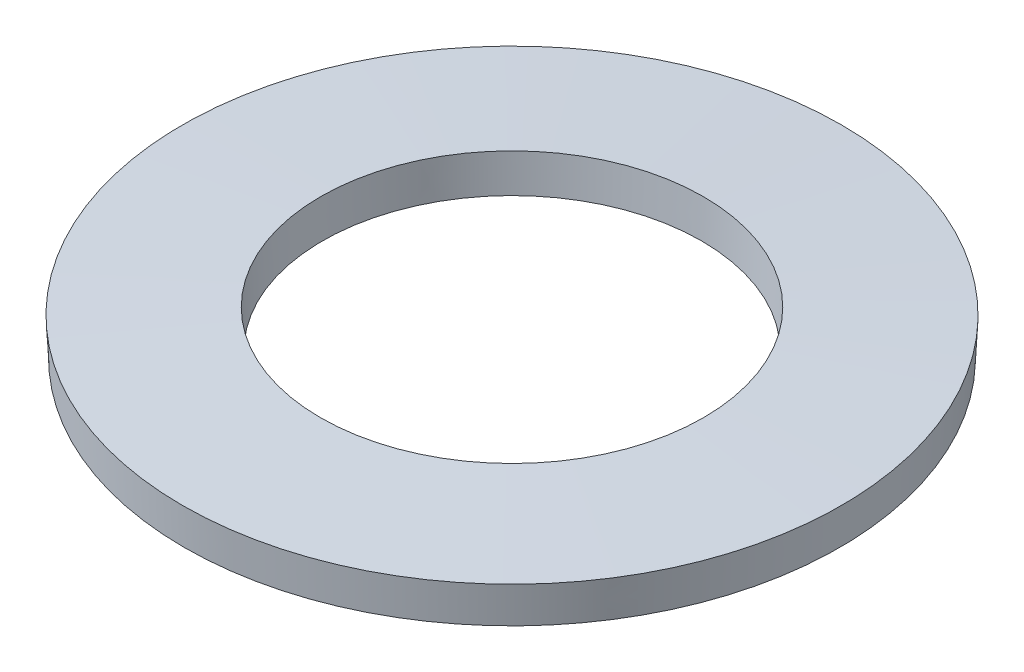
from build123d import *


with BuildPart() as part:
    # Esquisse1 → Base-R_volution (revolve)
    with BuildSketch(Plane.XY, mode=Mode.PRIVATE) as base_r_volution_sk:
        Polygon((-35, 0), (-20.25, 0.74), (-20.450425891, 4.734975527), (-35.200425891, 3.994975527), align=None)
    revolve(base_r_volution_sk.sketch.rotate(Axis((0, 0, 0), (0, 1, 0)), 270), axis=Axis((0, 0, 0), (0, 1, 0)))


solid = part.part
